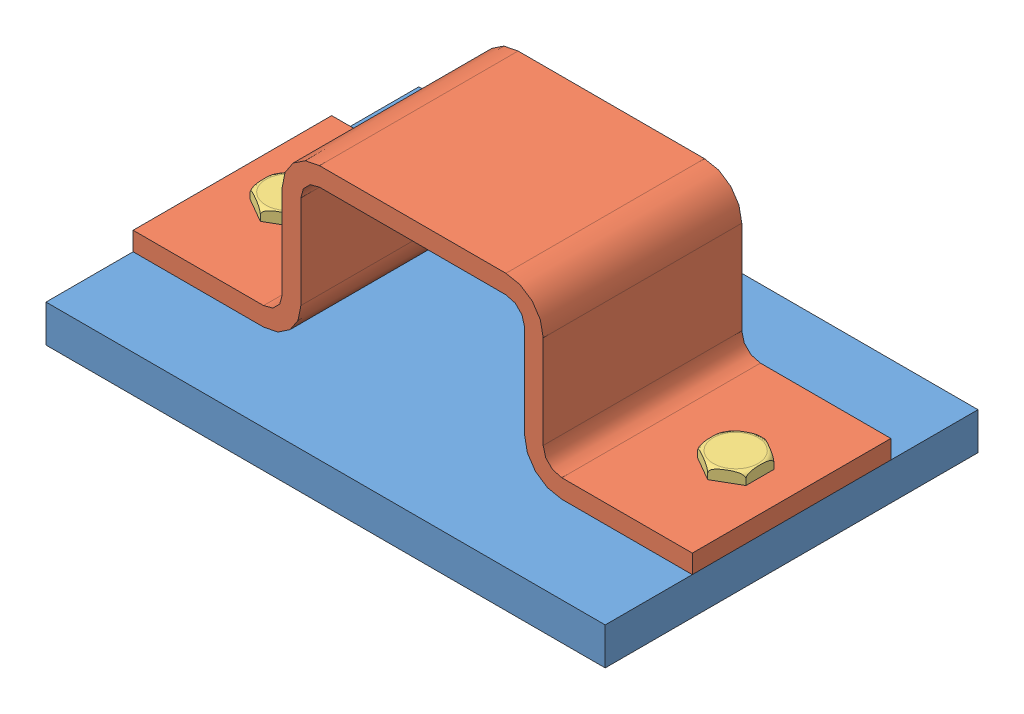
SolidWorks assembly replace components.SLDASM, configuration Default (file format 7000). Lengths in mm.
Overall size (150 55 100).
4 component instances, 3 part files, 6 mates.
Components (placement in the parent):
- Plate-1: Plate.SLDPRT [Default] at origin size (150 10 100)
- support-1: support.SLDPRT [Default] at (0 10 0) x (-1 0 0) z (0 1 0) size (150 53.27 45)
- bolt-1: bolt.SLDPRT [Default] at (60 0 0) size (13.75 18.28 15.76)
- bolt-2: bolt.SLDPRT [Default] at (-60 0 0) x (-1 0 0) z (0 0 -1) size (13.75 18.28 15.76)
Mates (geometry in assembly coordinates):
- Inplace1: in place: line of Plate-1 through (-75 10 50) axis (0 1 0); line of support-1 through (-1000 0 10) axis (0 0 1); moOrthogonalPlaneRef_w of Plate-1 through (-75 10 50) axis (0 1 0); line of support-1 through (0 10 0) axis (0 0 1); line of Plate-1 through (-75 10 50) axis (0 1 0); line of support-1 through (-1000 0 10) axis (0 -1 0); plane of Plate-1 through (-75 10 50) normal (0 1 0); unknown of support-1
- Coincident1: coincident aligned: plane of Plate-1; plane of support-1
- Coincident2: coincident aligned: moOrthogonalPlaneRef_w of Plate-1 through (0 10 0) axis (0 0 1); plane of support-1
- Coincident3: coincident anti-aligned: moOrthogonalPlaneRef_w of Plate-1 through (-1000 0 10) axis (0 1 0); plane of support-1
- Concentric1: concentric anti-aligned: cylinder of support-1 through (60 10 0) axis (0 1 0) radius 5; cylinder of bolt-1 through (60 15 0) axis (0 -1 0) radius 5
- Coincident1: coincident anti-aligned: plane of support-1 through (75 15 26.6348) normal (0 1 0); plane of bolt-1 through (60 15 7.5056) normal (0 -1 0)
